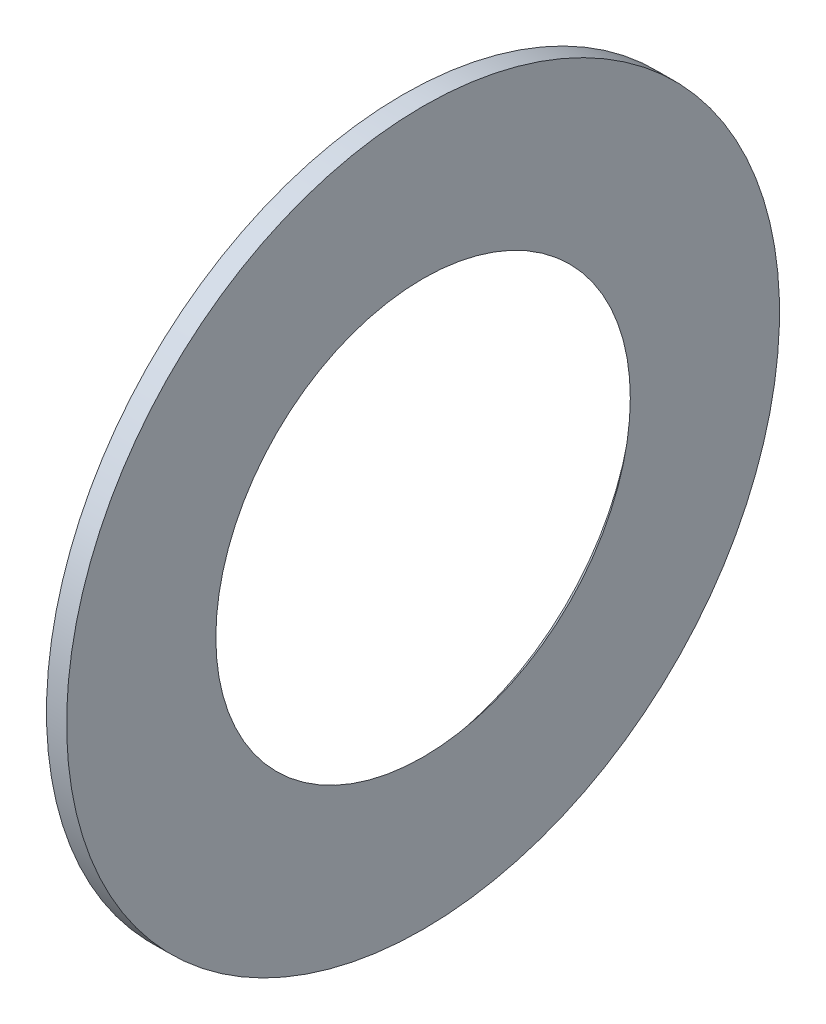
ISO-10303-21;
HEADER;
FILE_DESCRIPTION(('STEP AP214'),'2;1');
FILE_NAME('part.step','',(''),(''),'','','');
FILE_SCHEMA(('AUTOMOTIVE_DESIGN { 1 0 10303 214 1 1 1 1 }'));
ENDSEC;
DATA;
#1=APPLICATION_CONTEXT('core data for automotive mechanical design processes');
#2=APPLICATION_PROTOCOL_DEFINITION('international standard','automotive_design',2000,#1);
#3=PRODUCT_CONTEXT('',#1,'mechanical');
#4=PRODUCT('Part','Part','',(#3));
#5=PRODUCT_RELATED_PRODUCT_CATEGORY('part','',(#4));
#6=PRODUCT_DEFINITION_FORMATION('','',#4);
#7=PRODUCT_DEFINITION_CONTEXT('part definition',#1,'design');
#8=PRODUCT_DEFINITION('design','',#6,#7);
#9=PRODUCT_DEFINITION_SHAPE('','',#8);
#10=(LENGTH_UNIT() NAMED_UNIT(*) SI_UNIT(.MILLI.,.METRE.));
#11=(NAMED_UNIT(*) PLANE_ANGLE_UNIT() SI_UNIT($,.RADIAN.));
#12=(NAMED_UNIT(*) SI_UNIT($,.STERADIAN.) SOLID_ANGLE_UNIT());
#13=UNCERTAINTY_MEASURE_WITH_UNIT(LENGTH_MEASURE(1.E-05),#10,'distance_accuracy_value','');
#14=(GEOMETRIC_REPRESENTATION_CONTEXT(3) GLOBAL_UNCERTAINTY_ASSIGNED_CONTEXT((#13)) GLOBAL_UNIT_ASSIGNED_CONTEXT((#10,
#11,#12)) REPRESENTATION_CONTEXT('',''));
#15=CARTESIAN_POINT('',(0.,0.,0.));
#16=DIRECTION('',(0.,0.,1.));
#17=DIRECTION('',(1.,0.,0.));
#18=AXIS2_PLACEMENT_3D('',#15,#16,#17);
#19=CARTESIAN_POINT('',(8.22,13.5078460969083,0.));
#20=DIRECTION('',(-1.,0.,0.));
#21=DIRECTION('',(0.,0.,1.));
#22=AXIS2_PLACEMENT_3D('',#19,#20,#21);
#23=PLANE('',#22);
#24=CARTESIAN_POINT('',(8.22,0.,0.));
#25=DIRECTION('',(-1.,0.,0.));
#26=DIRECTION('',(0.,1.,0.));
#27=AXIS2_PLACEMENT_3D('',#24,#25,#26);
#28=CIRCLE('',#27,13.2078460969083);
#29=CARTESIAN_POINT('',(8.22,13.2078460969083,0.));
#30=VERTEX_POINT('',#29);
#31=EDGE_CURVE('E44',#30,#30,#28,.T.);
#32=ORIENTED_EDGE('',*,*,#31,.F.);
#33=EDGE_LOOP('',(#32));
#34=FACE_BOUND('',#33,.T.);
#35=CARTESIAN_POINT('',(8.22,0.,0.));
#36=DIRECTION('',(-1.,0.,0.));
#37=DIRECTION('',(0.,1.,0.));
#38=AXIS2_PLACEMENT_3D('',#35,#36,#37);
#39=CIRCLE('',#38,13.8078460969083);
#40=CARTESIAN_POINT('',(8.22,13.8078460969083,0.));
#41=VERTEX_POINT('',#40);
#42=EDGE_CURVE('E10',#41,#41,#39,.T.);
#43=ORIENTED_EDGE('',*,*,#42,.T.);
#44=EDGE_LOOP('',(#43));
#45=FACE_BOUND('',#44,.T.);
#46=ADVANCED_FACE('F15',(#34,#45),#23,.T.);
#47=CARTESIAN_POINT('',(9.,10.9178460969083,0.));
#48=DIRECTION('',(1.,0.,0.));
#49=DIRECTION('',(0.,0.,-1.));
#50=AXIS2_PLACEMENT_3D('',#47,#48,#49);
#51=PLANE('',#50);
#52=CARTESIAN_POINT('',(9.,0.,0.));
#53=DIRECTION('',(-1.,0.,0.));
#54=DIRECTION('',(0.,1.,0.));
#55=AXIS2_PLACEMENT_3D('',#52,#53,#54);
#56=CIRCLE('',#55,8.02784609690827);
#57=CARTESIAN_POINT('',(9.,8.02784609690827,0.));
#58=VERTEX_POINT('',#57);
#59=EDGE_CURVE('E24',#58,#58,#56,.T.);
#60=ORIENTED_EDGE('',*,*,#59,.T.);
#61=EDGE_LOOP('',(#60));
#62=FACE_BOUND('',#61,.T.);
#63=CARTESIAN_POINT('',(9.,0.,0.));
#64=DIRECTION('',(-1.,0.,0.));
#65=DIRECTION('',(0.,1.,0.));
#66=AXIS2_PLACEMENT_3D('',#63,#64,#65);
#67=CIRCLE('',#66,13.8078460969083);
#68=CARTESIAN_POINT('',(9.,13.8078460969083,0.));
#69=VERTEX_POINT('',#68);
#70=EDGE_CURVE('E38',#69,#69,#67,.T.);
#71=ORIENTED_EDGE('',*,*,#70,.F.);
#72=EDGE_LOOP('',(#71));
#73=FACE_BOUND('',#72,.T.);
#74=ADVANCED_FACE('F64',(#62,#73),#51,.T.);
#75=CARTESIAN_POINT('',(8.58,10.7641913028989,0.));
#76=DIRECTION('',(-1.,0.,0.));
#77=DIRECTION('',(0.,0.,1.));
#78=AXIS2_PLACEMENT_3D('',#75,#76,#77);
#79=PLANE('',#78);
#80=CARTESIAN_POINT('',(8.58,0.,0.));
#81=DIRECTION('',(-1.,0.,0.));
#82=DIRECTION('',(0.,1.,0.));
#83=AXIS2_PLACEMENT_3D('',#80,#81,#82);
#84=CIRCLE('',#83,8.52838260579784);
#85=CARTESIAN_POINT('',(8.58,8.52838260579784,0.));
#86=VERTEX_POINT('',#85);
#87=EDGE_CURVE('E40',#86,#86,#84,.T.);
#88=ORIENTED_EDGE('',*,*,#87,.F.);
#89=EDGE_LOOP('',(#88));
#90=FACE_BOUND('',#89,.T.);
#91=CARTESIAN_POINT('',(8.58,0.,0.));
#92=DIRECTION('',(-1.,0.,0.));
#93=DIRECTION('',(0.,1.,0.));
#94=AXIS2_PLACEMENT_3D('',#91,#92,#93);
#95=CIRCLE('',#94,13.);
#96=CARTESIAN_POINT('',(8.58,13.,0.));
#97=VERTEX_POINT('',#96);
#98=EDGE_CURVE('E34',#97,#97,#95,.T.);
#99=ORIENTED_EDGE('',*,*,#98,.T.);
#100=EDGE_LOOP('',(#99));
#101=FACE_BOUND('',#100,.T.);
#102=ADVANCED_FACE('F52',(#90,#101),#79,.T.);
#103=DIRECTION('',(-0.642787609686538,0.766044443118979,0.));
#104=VECTOR('',#103,1.);
#105=CARTESIAN_POINT('',(8.79,8.27811435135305,0.));
#106=LINE('',#105,#104);
#107=CARTESIAN_POINT('',(15.7361626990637,0.,0.));
#108=DIRECTION('',(-1.,0.,0.));
#109=AXIS1_PLACEMENT('',#107,#108);
#110=SURFACE_OF_REVOLUTION('',#106,#109);
#111=ORIENTED_EDGE('',*,*,#87,.T.);
#112=EDGE_LOOP('',(#111));
#113=FACE_BOUND('',#112,.T.);
#114=ORIENTED_EDGE('',*,*,#59,.F.);
#115=EDGE_LOOP('',(#114));
#116=FACE_BOUND('',#115,.T.);
#117=ADVANCED_FACE('F48',(#113,#116),#110,.F.);
#118=CARTESIAN_POINT('',(8.61,0.,0.));
#119=DIRECTION('',(-1.,0.,0.));
#120=DIRECTION('',(0.,0.,1.));
#121=AXIS2_PLACEMENT_3D('',#118,#119,#120);
#122=CYLINDRICAL_SURFACE('',#121,13.8078460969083);
#123=ORIENTED_EDGE('',*,*,#42,.F.);
#124=EDGE_LOOP('',(#123));
#125=FACE_BOUND('',#124,.T.);
#126=ORIENTED_EDGE('',*,*,#70,.T.);
#127=EDGE_LOOP('',(#126));
#128=FACE_BOUND('',#127,.T.);
#129=ADVANCED_FACE('F51',(#125,#128),#122,.T.);
#130=DIRECTION('',(-0.866025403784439,0.499999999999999,0.));
#131=VECTOR('',#130,1.);
#132=CARTESIAN_POINT('',(8.4,13.1039230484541,0.));
#133=LINE('',#132,#131);
#134=CARTESIAN_POINT('',(31.0966604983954,0.,0.));
#135=DIRECTION('',(-1.,0.,0.));
#136=AXIS1_PLACEMENT('',#134,#135);
#137=SURFACE_OF_REVOLUTION('',#133,#136);
#138=ORIENTED_EDGE('',*,*,#31,.T.);
#139=EDGE_LOOP('',(#138));
#140=FACE_BOUND('',#139,.T.);
#141=ORIENTED_EDGE('',*,*,#98,.F.);
#142=EDGE_LOOP('',(#141));
#143=FACE_BOUND('',#142,.T.);
#144=ADVANCED_FACE('F17',(#140,#143),#137,.F.);
#145=CLOSED_SHELL('',(#46,#74,#102,#117,#129,#144));
#146=MANIFOLD_SOLID_BREP('B1',#145);
#147=ADVANCED_BREP_SHAPE_REPRESENTATION('',(#18,#146),#14);
#148=SHAPE_DEFINITION_REPRESENTATION(#9,#147);
ENDSEC;
END-ISO-10303-21;
